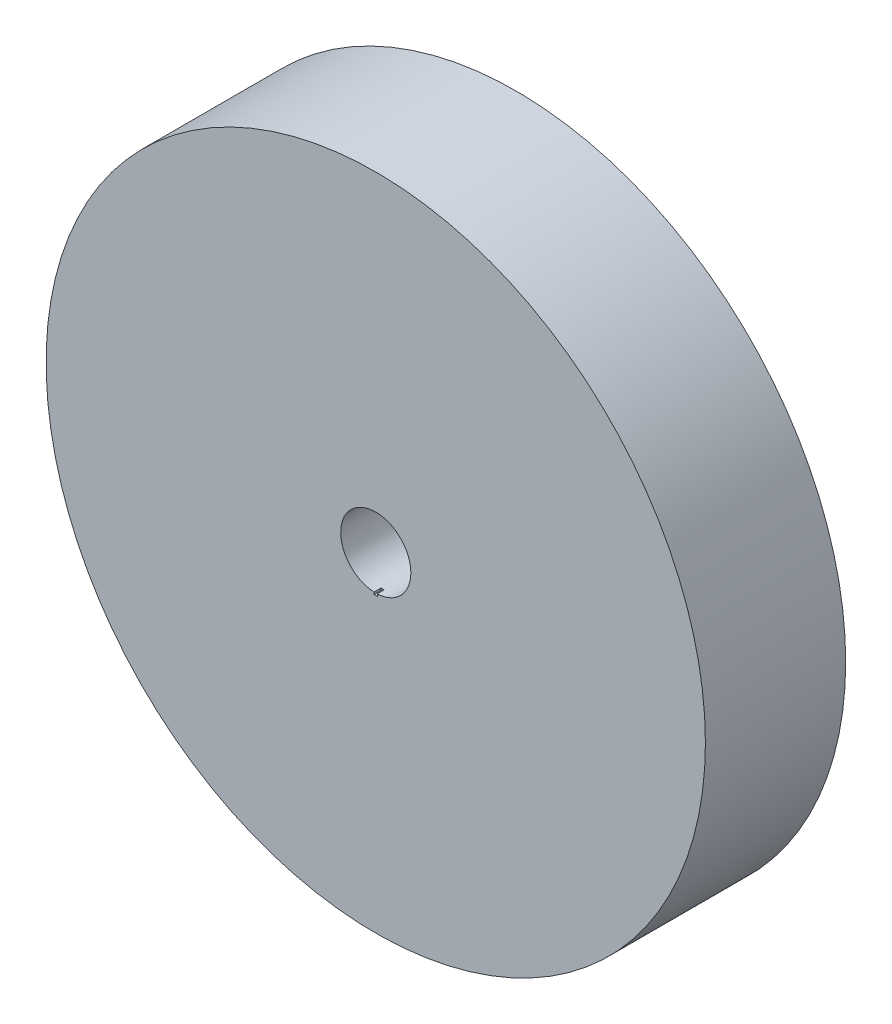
ISO-10303-21;
HEADER;
FILE_DESCRIPTION(('STEP AP214'),'2;1');
FILE_NAME('part.step','',(''),(''),'','','');
FILE_SCHEMA(('AUTOMOTIVE_DESIGN { 1 0 10303 214 1 1 1 1 }'));
ENDSEC;
DATA;
#1=APPLICATION_CONTEXT('core data for automotive mechanical design processes');
#2=APPLICATION_PROTOCOL_DEFINITION('international standard','automotive_design',2000,#1);
#3=PRODUCT_CONTEXT('',#1,'mechanical');
#4=PRODUCT('Part','Part','',(#3));
#5=PRODUCT_RELATED_PRODUCT_CATEGORY('part','',(#4));
#6=PRODUCT_DEFINITION_FORMATION('','',#4);
#7=PRODUCT_DEFINITION_CONTEXT('part definition',#1,'design');
#8=PRODUCT_DEFINITION('design','',#6,#7);
#9=PRODUCT_DEFINITION_SHAPE('','',#8);
#10=(LENGTH_UNIT() NAMED_UNIT(*) SI_UNIT(.MILLI.,.METRE.));
#11=(NAMED_UNIT(*) PLANE_ANGLE_UNIT() SI_UNIT($,.RADIAN.));
#12=(NAMED_UNIT(*) SI_UNIT($,.STERADIAN.) SOLID_ANGLE_UNIT());
#13=UNCERTAINTY_MEASURE_WITH_UNIT(LENGTH_MEASURE(1.E-05),#10,'distance_accuracy_value','');
#14=(GEOMETRIC_REPRESENTATION_CONTEXT(3) GLOBAL_UNCERTAINTY_ASSIGNED_CONTEXT((#13)) GLOBAL_UNIT_ASSIGNED_CONTEXT((#10,
#11,#12)) REPRESENTATION_CONTEXT('',''));
#15=CARTESIAN_POINT('',(0.,0.,0.));
#16=DIRECTION('',(0.,0.,1.));
#17=DIRECTION('',(1.,0.,0.));
#18=AXIS2_PLACEMENT_3D('',#15,#16,#17);
#19=CARTESIAN_POINT('',(0.,0.,-2.));
#20=DIRECTION('',(0.,0.,1.));
#21=DIRECTION('',(1.,0.,0.));
#22=AXIS2_PLACEMENT_3D('',#19,#20,#21);
#23=CYLINDRICAL_SURFACE('',#22,4.7);
#24=CARTESIAN_POINT('',(0.,0.,-2.));
#25=DIRECTION('',(0.,0.,1.));
#26=DIRECTION('',(1.,0.,0.));
#27=AXIS2_PLACEMENT_3D('',#24,#25,#26);
#28=CIRCLE('',#27,4.7);
#29=CARTESIAN_POINT('',(4.7,0.,-2.));
#30=VERTEX_POINT('',#29);
#31=EDGE_CURVE('E115',#30,#30,#28,.T.);
#32=ORIENTED_EDGE('',*,*,#31,.T.);
#33=EDGE_LOOP('',(#32));
#34=FACE_BOUND('',#33,.T.);
#35=CARTESIAN_POINT('',(0.,0.,0.));
#36=DIRECTION('',(0.,0.,1.));
#37=DIRECTION('',(1.,0.,0.));
#38=AXIS2_PLACEMENT_3D('',#35,#36,#37);
#39=CIRCLE('',#38,4.7);
#40=CARTESIAN_POINT('',(4.7,0.,0.));
#41=VERTEX_POINT('',#40);
#42=EDGE_CURVE('E112',#41,#41,#39,.T.);
#43=ORIENTED_EDGE('',*,*,#42,.F.);
#44=EDGE_LOOP('',(#43));
#45=FACE_BOUND('',#44,.T.);
#46=ADVANCED_FACE('F32',(#34,#45),#23,.T.);
#47=CARTESIAN_POINT('',(0.,0.,-2.));
#48=DIRECTION('',(0.,0.,1.));
#49=DIRECTION('',(1.,0.,0.));
#50=AXIS2_PLACEMENT_3D('',#47,#48,#49);
#51=PLANE('',#50);
#52=CARTESIAN_POINT('',(0.,0.,-2.));
#53=DIRECTION('',(0.,0.,1.));
#54=DIRECTION('',(1.,0.,0.));
#55=AXIS2_PLACEMENT_3D('',#52,#53,#54);
#56=CIRCLE('',#55,0.5);
#57=CARTESIAN_POINT('',(0.5,0.,-2.));
#58=VERTEX_POINT('',#57);
#59=EDGE_CURVE('E109',#58,#58,#56,.T.);
#60=ORIENTED_EDGE('',*,*,#59,.T.);
#61=EDGE_LOOP('',(#60));
#62=FACE_BOUND('',#61,.T.);
#63=ORIENTED_EDGE('',*,*,#31,.F.);
#64=EDGE_LOOP('',(#63));
#65=FACE_BOUND('',#64,.T.);
#66=ADVANCED_FACE('F134',(#62,#65),#51,.F.);
#67=CARTESIAN_POINT('',(0.,0.,0.));
#68=DIRECTION('',(0.,0.,1.));
#69=DIRECTION('',(1.,0.,0.));
#70=AXIS2_PLACEMENT_3D('',#67,#68,#69);
#71=PLANE('',#70);
#72=DIRECTION('',(0.,-1.,0.));
#73=VECTOR('',#72,1.);
#74=CARTESIAN_POINT('',(-0.0244294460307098,-0.31235200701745,0.));
#75=LINE('',#74,#73);
#76=CARTESIAN_POINT('',(-0.0244294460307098,-0.499402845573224,0.));
#77=VERTEX_POINT('',#76);
#78=CARTESIAN_POINT('',(-0.0244294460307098,-0.529970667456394,0.));
#79=VERTEX_POINT('',#78);
#80=EDGE_CURVE('E73',#77,#79,#75,.T.);
#81=ORIENTED_EDGE('',*,*,#80,.F.);
#82=CARTESIAN_POINT('',(0.,0.,0.));
#83=DIRECTION('',(0.,0.,1.));
#84=DIRECTION('',(1.,0.,0.));
#85=AXIS2_PLACEMENT_3D('',#82,#83,#84);
#86=CIRCLE('',#85,0.5);
#87=CARTESIAN_POINT('',(0.0213850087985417,-0.499542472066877,0.));
#88=VERTEX_POINT('',#87);
#89=EDGE_CURVE('E105',#88,#77,#86,.T.);
#90=ORIENTED_EDGE('',*,*,#89,.F.);
#91=DIRECTION('',(0.,1.,0.));
#92=VECTOR('',#91,1.);
#93=CARTESIAN_POINT('',(0.0213850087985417,-0.31235200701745,0.));
#94=LINE('',#93,#92);
#95=CARTESIAN_POINT('',(0.0213850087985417,-0.529970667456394,0.));
#96=VERTEX_POINT('',#95);
#97=EDGE_CURVE('E94',#96,#88,#94,.T.);
#98=ORIENTED_EDGE('',*,*,#97,.F.);
#99=DIRECTION('',(1.,0.,0.));
#100=VECTOR('',#99,1.);
#101=CARTESIAN_POINT('',(-0.0244294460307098,-0.529970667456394,0.));
#102=LINE('',#101,#100);
#103=EDGE_CURVE('E82',#79,#96,#102,.T.);
#104=ORIENTED_EDGE('',*,*,#103,.F.);
#105=EDGE_LOOP('',(#81,#90,#98,#104));
#106=FACE_BOUND('',#105,.T.);
#107=ORIENTED_EDGE('',*,*,#42,.T.);
#108=EDGE_LOOP('',(#107));
#109=FACE_BOUND('',#108,.T.);
#110=ADVANCED_FACE('F92',(#106,#109),#71,.T.);
#111=CARTESIAN_POINT('',(0.,0.,-2.));
#112=DIRECTION('',(0.,0.,1.));
#113=DIRECTION('',(1.,0.,0.));
#114=AXIS2_PLACEMENT_3D('',#111,#112,#113);
#115=CYLINDRICAL_SURFACE('',#114,0.5);
#116=ORIENTED_EDGE('',*,*,#89,.T.);
#117=DIRECTION('',(0.,0.,1.));
#118=VECTOR('',#117,1.);
#119=CARTESIAN_POINT('',(-0.0244294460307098,-0.499402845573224,-2.));
#120=LINE('',#119,#118);
#121=CARTESIAN_POINT('',(-0.0244294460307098,-0.499402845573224,-0.1));
#122=VERTEX_POINT('',#121);
#123=EDGE_CURVE('E11',#77,#122,#120,.F.);
#124=ORIENTED_EDGE('',*,*,#123,.T.);
#125=CARTESIAN_POINT('',(0.,0.,-0.1));
#126=DIRECTION('',(0.,0.,1.));
#127=DIRECTION('',(1.,0.,0.));
#128=AXIS2_PLACEMENT_3D('',#125,#126,#127);
#129=CIRCLE('',#128,0.5);
#130=CARTESIAN_POINT('',(0.0213850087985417,-0.499542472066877,-0.1));
#131=VERTEX_POINT('',#130);
#132=EDGE_CURVE('E51',#131,#122,#129,.F.);
#133=ORIENTED_EDGE('',*,*,#132,.F.);
#134=DIRECTION('',(0.,0.,1.));
#135=VECTOR('',#134,1.);
#136=CARTESIAN_POINT('',(0.0213850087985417,-0.499542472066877,-2.));
#137=LINE('',#136,#135);
#138=EDGE_CURVE('E39',#131,#88,#137,.T.);
#139=ORIENTED_EDGE('',*,*,#138,.T.);
#140=EDGE_LOOP('',(#116,#124,#133,#139));
#141=FACE_BOUND('',#140,.T.);
#142=ORIENTED_EDGE('',*,*,#59,.F.);
#143=EDGE_LOOP('',(#142));
#144=FACE_BOUND('',#143,.T.);
#145=ADVANCED_FACE('F120',(#141,#144),#115,.F.);
#146=CARTESIAN_POINT('',(-0.0244294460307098,-0.31235200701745,-0.1));
#147=DIRECTION('',(-1.,0.,0.));
#148=DIRECTION('',(0.,0.,1.));
#149=AXIS2_PLACEMENT_3D('',#146,#147,#148);
#150=PLANE('',#149);
#151=ORIENTED_EDGE('',*,*,#80,.T.);
#152=DIRECTION('',(0.,0.,1.));
#153=VECTOR('',#152,1.);
#154=CARTESIAN_POINT('',(-0.0244294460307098,-0.529970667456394,-0.1));
#155=LINE('',#154,#153);
#156=CARTESIAN_POINT('',(-0.0244294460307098,-0.529970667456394,-0.1));
#157=VERTEX_POINT('',#156);
#158=EDGE_CURVE('E76',#157,#79,#155,.T.);
#159=ORIENTED_EDGE('',*,*,#158,.F.);
#160=DIRECTION('',(0.,-1.,0.));
#161=VECTOR('',#160,1.);
#162=CARTESIAN_POINT('',(-0.0244294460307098,-0.31235200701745,-0.1));
#163=LINE('',#162,#161);
#164=EDGE_CURVE('E99',#122,#157,#163,.T.);
#165=ORIENTED_EDGE('',*,*,#164,.F.);
#166=ORIENTED_EDGE('',*,*,#123,.F.);
#167=EDGE_LOOP('',(#151,#159,#165,#166));
#168=FACE_BOUND('',#167,.T.);
#169=ADVANCED_FACE('F75',(#168),#150,.F.);
#170=CARTESIAN_POINT('',(0.0213850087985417,-0.31235200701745,-0.1));
#171=DIRECTION('',(1.,0.,0.));
#172=DIRECTION('',(0.,0.,-1.));
#173=AXIS2_PLACEMENT_3D('',#170,#171,#172);
#174=PLANE('',#173);
#175=DIRECTION('',(0.,1.,0.));
#176=VECTOR('',#175,1.);
#177=CARTESIAN_POINT('',(0.0213850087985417,-0.31235200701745,-0.1));
#178=LINE('',#177,#176);
#179=CARTESIAN_POINT('',(0.0213850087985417,-0.529970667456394,-0.1));
#180=VERTEX_POINT('',#179);
#181=EDGE_CURVE('E46',#180,#131,#178,.T.);
#182=ORIENTED_EDGE('',*,*,#181,.F.);
#183=DIRECTION('',(0.,0.,1.));
#184=VECTOR('',#183,1.);
#185=CARTESIAN_POINT('',(0.0213850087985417,-0.529970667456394,-0.1));
#186=LINE('',#185,#184);
#187=EDGE_CURVE('E89',#180,#96,#186,.T.);
#188=ORIENTED_EDGE('',*,*,#187,.T.);
#189=ORIENTED_EDGE('',*,*,#97,.T.);
#190=ORIENTED_EDGE('',*,*,#138,.F.);
#191=EDGE_LOOP('',(#182,#188,#189,#190));
#192=FACE_BOUND('',#191,.T.);
#193=ADVANCED_FACE('F123',(#192),#174,.F.);
#194=CARTESIAN_POINT('',(-0.0244294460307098,-0.529970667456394,-0.1));
#195=DIRECTION('',(0.,0.,1.));
#196=DIRECTION('',(1.,0.,0.));
#197=AXIS2_PLACEMENT_3D('',#194,#195,#196);
#198=PLANE('',#197);
#199=ORIENTED_EDGE('',*,*,#132,.T.);
#200=ORIENTED_EDGE('',*,*,#164,.T.);
#201=DIRECTION('',(1.,0.,0.));
#202=VECTOR('',#201,1.);
#203=CARTESIAN_POINT('',(-0.0244294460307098,-0.529970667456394,-0.1));
#204=LINE('',#203,#202);
#205=EDGE_CURVE('E88',#157,#180,#204,.T.);
#206=ORIENTED_EDGE('',*,*,#205,.T.);
#207=ORIENTED_EDGE('',*,*,#181,.T.);
#208=EDGE_LOOP('',(#199,#200,#206,#207));
#209=FACE_BOUND('',#208,.T.);
#210=ADVANCED_FACE('F124',(#209),#198,.T.);
#211=CARTESIAN_POINT('',(-0.0244294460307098,-0.529970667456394,-0.1));
#212=DIRECTION('',(0.,-1.,0.));
#213=DIRECTION('',(0.,0.,-1.));
#214=AXIS2_PLACEMENT_3D('',#211,#212,#213);
#215=PLANE('',#214);
#216=ORIENTED_EDGE('',*,*,#103,.T.);
#217=ORIENTED_EDGE('',*,*,#187,.F.);
#218=ORIENTED_EDGE('',*,*,#205,.F.);
#219=ORIENTED_EDGE('',*,*,#158,.T.);
#220=EDGE_LOOP('',(#216,#217,#218,#219));
#221=FACE_BOUND('',#220,.T.);
#222=ADVANCED_FACE('F86',(#221),#215,.F.);
#223=CLOSED_SHELL('',(#46,#66,#110,#145,#169,#193,#210,#222));
#224=MANIFOLD_SOLID_BREP('B2',#223);
#225=ADVANCED_BREP_SHAPE_REPRESENTATION('',(#18,#224),#14);
#226=SHAPE_DEFINITION_REPRESENTATION(#9,#225);
ENDSEC;
END-ISO-10303-21;
